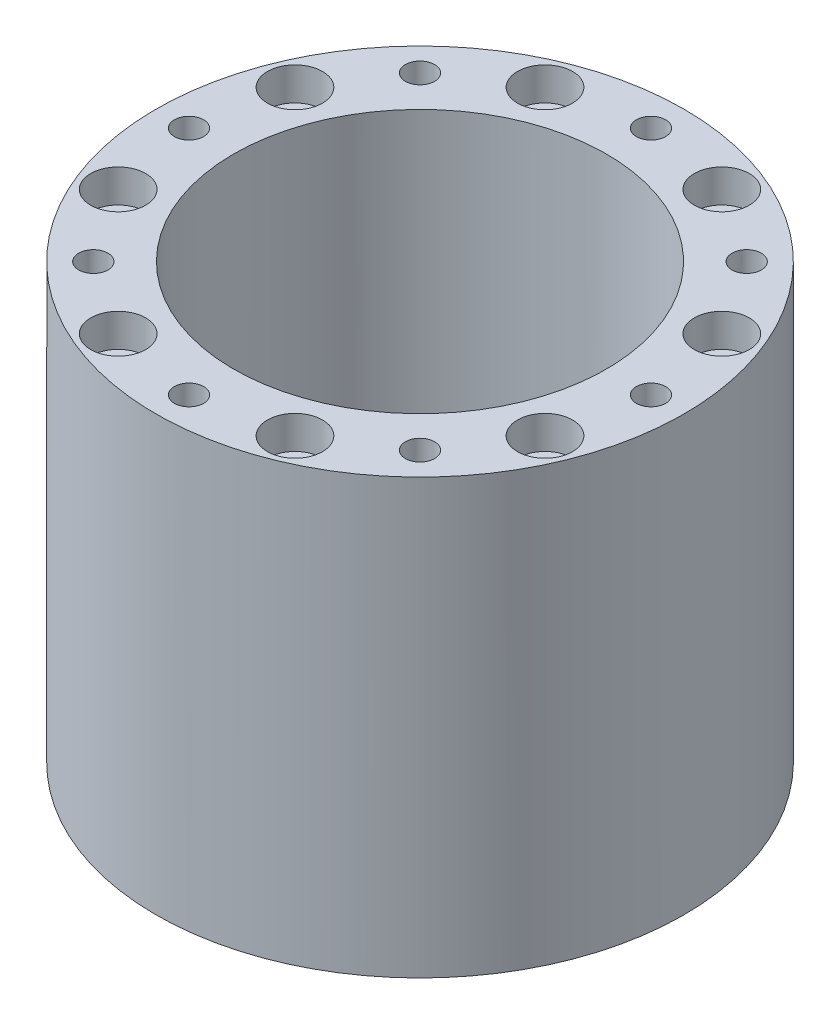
ISO-10303-21;
HEADER;
FILE_DESCRIPTION(('STEP AP214'),'2;1');
FILE_NAME('part.step','',(''),(''),'','','');
FILE_SCHEMA(('AUTOMOTIVE_DESIGN { 1 0 10303 214 1 1 1 1 }'));
ENDSEC;
DATA;
#1=APPLICATION_CONTEXT('core data for automotive mechanical design processes');
#2=APPLICATION_PROTOCOL_DEFINITION('international standard','automotive_design',2000,#1);
#3=PRODUCT_CONTEXT('',#1,'mechanical');
#4=PRODUCT('Part','Part','',(#3));
#5=PRODUCT_RELATED_PRODUCT_CATEGORY('part','',(#4));
#6=PRODUCT_DEFINITION_FORMATION('','',#4);
#7=PRODUCT_DEFINITION_CONTEXT('part definition',#1,'design');
#8=PRODUCT_DEFINITION('design','',#6,#7);
#9=PRODUCT_DEFINITION_SHAPE('','',#8);
#10=(LENGTH_UNIT() NAMED_UNIT(*) SI_UNIT(.MILLI.,.METRE.));
#11=(NAMED_UNIT(*) PLANE_ANGLE_UNIT() SI_UNIT($,.RADIAN.));
#12=(NAMED_UNIT(*) SI_UNIT($,.STERADIAN.) SOLID_ANGLE_UNIT());
#13=UNCERTAINTY_MEASURE_WITH_UNIT(LENGTH_MEASURE(1.E-05),#10,'distance_accuracy_value','');
#14=(GEOMETRIC_REPRESENTATION_CONTEXT(3) GLOBAL_UNCERTAINTY_ASSIGNED_CONTEXT((#13)) GLOBAL_UNIT_ASSIGNED_CONTEXT((#10,
#11,#12)) REPRESENTATION_CONTEXT('',''));
#15=CARTESIAN_POINT('',(0.,0.,0.));
#16=DIRECTION('',(0.,0.,1.));
#17=DIRECTION('',(1.,0.,0.));
#18=AXIS2_PLACEMENT_3D('',#15,#16,#17);
#19=CARTESIAN_POINT('',(63.7922857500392,0.,41.677143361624));
#20=DIRECTION('',(0.,-1.,0.));
#21=DIRECTION('',(0.546944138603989,0.,-0.837169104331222));
#22=AXIS2_PLACEMENT_3D('',#19,#20,#21);
#23=PLANE('',#22);
#24=CARTESIAN_POINT('',(61.5996678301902,0.,-25.515417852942));
#25=DIRECTION('',(0.,1.,0.));
#26=DIRECTION('',(0.,0.,1.));
#27=AXIS2_PLACEMENT_3D('',#24,#25,#26);
#28=CIRCLE('',#27,7.93750000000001);
#29=CARTESIAN_POINT('',(61.5996678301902,0.,-17.577917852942));
#30=VERTEX_POINT('',#29);
#31=EDGE_CURVE('E661',#30,#30,#28,.T.);
#32=ORIENTED_EDGE('',*,*,#31,.F.);
#33=EDGE_LOOP('',(#32));
#34=FACE_BOUND('',#33,.T.);
#35=CARTESIAN_POINT('',(-25.5154178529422,0.,-61.5996678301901));
#36=DIRECTION('',(0.,1.,0.));
#37=DIRECTION('',(0.,0.,1.));
#38=AXIS2_PLACEMENT_3D('',#35,#36,#37);
#39=CIRCLE('',#38,7.9375);
#40=CARTESIAN_POINT('',(-25.5154178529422,0.,-53.6621678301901));
#41=VERTEX_POINT('',#40);
#42=EDGE_CURVE('E192',#41,#41,#39,.T.);
#43=ORIENTED_EDGE('',*,*,#42,.F.);
#44=EDGE_LOOP('',(#43));
#45=FACE_BOUND('',#44,.T.);
#46=CARTESIAN_POINT('',(-61.5996678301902,0.,-25.515417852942));
#47=DIRECTION('',(0.,1.,0.));
#48=DIRECTION('',(0.,0.,1.));
#49=AXIS2_PLACEMENT_3D('',#46,#47,#48);
#50=CIRCLE('',#49,7.9375);
#51=CARTESIAN_POINT('',(-61.5996678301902,0.,-17.577917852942));
#52=VERTEX_POINT('',#51);
#53=EDGE_CURVE('E204',#52,#52,#50,.T.);
#54=ORIENTED_EDGE('',*,*,#53,.F.);
#55=EDGE_LOOP('',(#54));
#56=FACE_BOUND('',#55,.T.);
#57=CARTESIAN_POINT('',(-61.59966783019,0.,25.5154178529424));
#58=DIRECTION('',(0.,1.,0.));
#59=DIRECTION('',(0.,0.,1.));
#60=AXIS2_PLACEMENT_3D('',#57,#58,#59);
#61=CIRCLE('',#60,7.9375);
#62=CARTESIAN_POINT('',(-61.59966783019,0.,33.4529178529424));
#63=VERTEX_POINT('',#62);
#64=EDGE_CURVE('E216',#63,#63,#61,.T.);
#65=ORIENTED_EDGE('',*,*,#64,.F.);
#66=EDGE_LOOP('',(#65));
#67=FACE_BOUND('',#66,.T.);
#68=CARTESIAN_POINT('',(-25.5154178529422,0.,61.5996678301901));
#69=DIRECTION('',(0.,1.,0.));
#70=DIRECTION('',(0.,0.,1.));
#71=AXIS2_PLACEMENT_3D('',#68,#69,#70);
#72=CIRCLE('',#71,7.9375);
#73=CARTESIAN_POINT('',(-25.5154178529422,0.,69.5371678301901));
#74=VERTEX_POINT('',#73);
#75=EDGE_CURVE('E228',#74,#74,#72,.T.);
#76=ORIENTED_EDGE('',*,*,#75,.F.);
#77=EDGE_LOOP('',(#76));
#78=FACE_BOUND('',#77,.T.);
#79=CARTESIAN_POINT('',(25.5154178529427,0.,61.5996678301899));
#80=DIRECTION('',(0.,1.,0.));
#81=DIRECTION('',(0.,0.,1.));
#82=AXIS2_PLACEMENT_3D('',#79,#80,#81);
#83=CIRCLE('',#82,7.9375);
#84=CARTESIAN_POINT('',(25.5154178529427,0.,69.5371678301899));
#85=VERTEX_POINT('',#84);
#86=EDGE_CURVE('E240',#85,#85,#83,.T.);
#87=ORIENTED_EDGE('',*,*,#86,.F.);
#88=EDGE_LOOP('',(#87));
#89=FACE_BOUND('',#88,.T.);
#90=CARTESIAN_POINT('',(47.1463446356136,0.,-47.1463446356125));
#91=DIRECTION('',(0.,1.,0.));
#92=DIRECTION('',(0.,0.,1.));
#93=AXIS2_PLACEMENT_3D('',#90,#91,#92);
#94=CIRCLE('',#93,4.21639999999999);
#95=CARTESIAN_POINT('',(47.1463446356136,0.,-42.9299446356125));
#96=VERTEX_POINT('',#95);
#97=EDGE_CURVE('E94',#96,#96,#94,.T.);
#98=ORIENTED_EDGE('',*,*,#97,.F.);
#99=EDGE_LOOP('',(#98));
#100=FACE_BOUND('',#99,.T.);
#101=CARTESIAN_POINT('',(6.98383554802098E-13,0.,-66.675));
#102=DIRECTION('',(0.,1.,0.));
#103=DIRECTION('',(0.,0.,1.));
#104=AXIS2_PLACEMENT_3D('',#101,#102,#103);
#105=CIRCLE('',#104,4.21639999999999);
#106=CARTESIAN_POINT('',(6.98383554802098E-13,0.,-62.4586));
#107=VERTEX_POINT('',#106);
#108=EDGE_CURVE('E93',#107,#107,#105,.T.);
#109=ORIENTED_EDGE('',*,*,#108,.F.);
#110=EDGE_LOOP('',(#109));
#111=FACE_BOUND('',#110,.T.);
#112=CARTESIAN_POINT('',(-47.1463446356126,0.,-47.1463446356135));
#113=DIRECTION('',(0.,1.,0.));
#114=DIRECTION('',(0.,0.,1.));
#115=AXIS2_PLACEMENT_3D('',#112,#113,#114);
#116=CIRCLE('',#115,4.21639999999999);
#117=CARTESIAN_POINT('',(-47.1463446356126,0.,-42.9299446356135));
#118=VERTEX_POINT('',#117);
#119=EDGE_CURVE('E106',#118,#118,#116,.T.);
#120=ORIENTED_EDGE('',*,*,#119,.F.);
#121=EDGE_LOOP('',(#120));
#122=FACE_BOUND('',#121,.T.);
#123=CARTESIAN_POINT('',(-66.675,0.,0.));
#124=DIRECTION('',(0.,1.,0.));
#125=DIRECTION('',(0.,0.,1.));
#126=AXIS2_PLACEMENT_3D('',#123,#124,#125);
#127=CIRCLE('',#126,4.21639999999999);
#128=CARTESIAN_POINT('',(-66.675,0.,4.21639999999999));
#129=VERTEX_POINT('',#128);
#130=EDGE_CURVE('E112',#129,#129,#127,.T.);
#131=ORIENTED_EDGE('',*,*,#130,.F.);
#132=EDGE_LOOP('',(#131));
#133=FACE_BOUND('',#132,.T.);
#134=CARTESIAN_POINT('',(-47.1463446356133,0.,47.1463446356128));
#135=DIRECTION('',(0.,1.,0.));
#136=DIRECTION('',(0.,0.,1.));
#137=AXIS2_PLACEMENT_3D('',#134,#135,#136);
#138=CIRCLE('',#137,4.21639999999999);
#139=CARTESIAN_POINT('',(-47.1463446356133,0.,51.3627446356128));
#140=VERTEX_POINT('',#139);
#141=EDGE_CURVE('E118',#140,#140,#138,.T.);
#142=ORIENTED_EDGE('',*,*,#141,.F.);
#143=EDGE_LOOP('',(#142));
#144=FACE_BOUND('',#143,.T.);
#145=CARTESIAN_POINT('',(-2.32794518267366E-13,0.,66.675));
#146=DIRECTION('',(0.,1.,0.));
#147=DIRECTION('',(0.,0.,1.));
#148=AXIS2_PLACEMENT_3D('',#145,#146,#147);
#149=CIRCLE('',#148,4.21639999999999);
#150=CARTESIAN_POINT('',(-2.32794518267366E-13,0.,70.8914));
#151=VERTEX_POINT('',#150);
#152=EDGE_CURVE('E124',#151,#151,#149,.T.);
#153=ORIENTED_EDGE('',*,*,#152,.F.);
#154=EDGE_LOOP('',(#153));
#155=FACE_BOUND('',#154,.T.);
#156=CARTESIAN_POINT('',(47.146344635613,0.,47.1463446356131));
#157=DIRECTION('',(0.,1.,0.));
#158=DIRECTION('',(0.,0.,1.));
#159=AXIS2_PLACEMENT_3D('',#156,#157,#158);
#160=CIRCLE('',#159,4.21639999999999);
#161=CARTESIAN_POINT('',(47.146344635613,0.,51.3627446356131));
#162=VERTEX_POINT('',#161);
#163=EDGE_CURVE('E130',#162,#162,#160,.T.);
#164=ORIENTED_EDGE('',*,*,#163,.F.);
#165=EDGE_LOOP('',(#164));
#166=FACE_BOUND('',#165,.T.);
#167=CARTESIAN_POINT('',(66.675,0.,0.));
#168=DIRECTION('',(0.,1.,0.));
#169=DIRECTION('',(0.,0.,1.));
#170=AXIS2_PLACEMENT_3D('',#167,#168,#169);
#171=CIRCLE('',#170,4.21639999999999);
#172=CARTESIAN_POINT('',(66.675,0.,4.21639999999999));
#173=VERTEX_POINT('',#172);
#174=EDGE_CURVE('E136',#173,#173,#171,.T.);
#175=ORIENTED_EDGE('',*,*,#174,.F.);
#176=EDGE_LOOP('',(#175));
#177=FACE_BOUND('',#176,.T.);
#178=CARTESIAN_POINT('',(0.,0.,0.));
#179=DIRECTION('',(0.,-1.,0.));
#180=DIRECTION('',(0.546944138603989,0.,-0.837169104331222));
#181=AXIS2_PLACEMENT_3D('',#178,#179,#180);
#182=CIRCLE('',#181,76.2);
#183=CARTESIAN_POINT('',(41.6771433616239,0.,-63.7922857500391));
#184=VERTEX_POINT('',#183);
#185=EDGE_CURVE('E142',#184,#184,#182,.T.);
#186=ORIENTED_EDGE('',*,*,#185,.F.);
#187=EDGE_LOOP('',(#186));
#188=FACE_BOUND('',#187,.T.);
#189=CARTESIAN_POINT('',(0.,0.,0.));
#190=DIRECTION('',(0.,-1.,0.));
#191=DIRECTION('',(0.546944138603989,0.,-0.837169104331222));
#192=AXIS2_PLACEMENT_3D('',#189,#190,#191);
#193=CIRCLE('',#192,53.7924602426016);
#194=CARTESIAN_POINT('',(29.421470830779,0.,-45.0333857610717));
#195=VERTEX_POINT('',#194);
#196=EDGE_CURVE('E145',#195,#195,#193,.T.);
#197=ORIENTED_EDGE('',*,*,#196,.T.);
#198=EDGE_LOOP('',(#197));
#199=FACE_BOUND('',#198,.T.);
#200=CARTESIAN_POINT('',(61.5996678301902,0.,25.515417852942));
#201=DIRECTION('',(0.,1.,0.));
#202=DIRECTION('',(0.,0.,1.));
#203=AXIS2_PLACEMENT_3D('',#200,#201,#202);
#204=CIRCLE('',#203,7.9375);
#205=CARTESIAN_POINT('',(61.5996678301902,0.,33.452917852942));
#206=VERTEX_POINT('',#205);
#207=EDGE_CURVE('E171',#206,#206,#204,.T.);
#208=ORIENTED_EDGE('',*,*,#207,.F.);
#209=EDGE_LOOP('',(#208));
#210=FACE_BOUND('',#209,.T.);
#211=CARTESIAN_POINT('',(25.5154178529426,0.,-61.59966783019));
#212=DIRECTION('',(0.,1.,0.));
#213=DIRECTION('',(0.,0.,1.));
#214=AXIS2_PLACEMENT_3D('',#211,#212,#213);
#215=CIRCLE('',#214,7.9375);
#216=CARTESIAN_POINT('',(25.5154178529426,0.,-53.66216783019));
#217=VERTEX_POINT('',#216);
#218=EDGE_CURVE('E174',#217,#217,#215,.T.);
#219=ORIENTED_EDGE('',*,*,#218,.F.);
#220=EDGE_LOOP('',(#219));
#221=FACE_BOUND('',#220,.T.);
#222=ADVANCED_FACE('F50',(#34,#45,#56,#67,#78,#89,#100,#111,#122,#133,#144,#155,#166,#177,#188,
#199,#210,#221),#23,.F.);
#223=CARTESIAN_POINT('',(-105.474898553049,-125.205020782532,22.1235140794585));
#224=DIRECTION('',(0.,1.,0.));
#225=DIRECTION('',(-0.546944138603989,0.,0.837169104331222));
#226=AXIS2_PLACEMENT_3D('',#223,#224,#225);
#227=PLANE('',#226);
#228=CARTESIAN_POINT('',(61.5996678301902,-125.205020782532,-25.515417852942));
#229=DIRECTION('',(0.,1.,0.));
#230=DIRECTION('',(0.,0.,1.));
#231=AXIS2_PLACEMENT_3D('',#228,#229,#230);
#232=CIRCLE('',#231,4.90219999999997);
#233=CARTESIAN_POINT('',(61.5996678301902,-125.205020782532,-20.613217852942));
#234=VERTEX_POINT('',#233);
#235=EDGE_CURVE('E177',#234,#234,#232,.T.);
#236=ORIENTED_EDGE('',*,*,#235,.T.);
#237=EDGE_LOOP('',(#236));
#238=FACE_BOUND('',#237,.T.);
#239=CARTESIAN_POINT('',(25.5154178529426,-125.205020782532,-61.59966783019));
#240=DIRECTION('',(0.,1.,0.));
#241=DIRECTION('',(0.,0.,1.));
#242=AXIS2_PLACEMENT_3D('',#239,#240,#241);
#243=CIRCLE('',#242,4.90219999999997);
#244=CARTESIAN_POINT('',(25.5154178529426,-125.205020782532,-56.69746783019));
#245=VERTEX_POINT('',#244);
#246=EDGE_CURVE('E189',#245,#245,#243,.T.);
#247=ORIENTED_EDGE('',*,*,#246,.T.);
#248=EDGE_LOOP('',(#247));
#249=FACE_BOUND('',#248,.T.);
#250=CARTESIAN_POINT('',(-25.5154178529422,-125.205020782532,-61.5996678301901));
#251=DIRECTION('',(0.,1.,0.));
#252=DIRECTION('',(0.,0.,1.));
#253=AXIS2_PLACEMENT_3D('',#250,#251,#252);
#254=CIRCLE('',#253,4.90219999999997);
#255=CARTESIAN_POINT('',(-25.5154178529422,-125.205020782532,-56.6974678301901));
#256=VERTEX_POINT('',#255);
#257=EDGE_CURVE('E201',#256,#256,#254,.T.);
#258=ORIENTED_EDGE('',*,*,#257,.T.);
#259=EDGE_LOOP('',(#258));
#260=FACE_BOUND('',#259,.T.);
#261=CARTESIAN_POINT('',(-61.5996678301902,-125.205020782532,-25.515417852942));
#262=DIRECTION('',(0.,1.,0.));
#263=DIRECTION('',(0.,0.,1.));
#264=AXIS2_PLACEMENT_3D('',#261,#262,#263);
#265=CIRCLE('',#264,4.90219999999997);
#266=CARTESIAN_POINT('',(-61.5996678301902,-125.205020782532,-20.613217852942));
#267=VERTEX_POINT('',#266);
#268=EDGE_CURVE('E213',#267,#267,#265,.T.);
#269=ORIENTED_EDGE('',*,*,#268,.T.);
#270=EDGE_LOOP('',(#269));
#271=FACE_BOUND('',#270,.T.);
#272=CARTESIAN_POINT('',(-61.59966783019,-125.205020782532,25.5154178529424));
#273=DIRECTION('',(0.,1.,0.));
#274=DIRECTION('',(0.,0.,1.));
#275=AXIS2_PLACEMENT_3D('',#272,#273,#274);
#276=CIRCLE('',#275,4.90219999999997);
#277=CARTESIAN_POINT('',(-61.59966783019,-125.205020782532,30.4176178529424));
#278=VERTEX_POINT('',#277);
#279=EDGE_CURVE('E225',#278,#278,#276,.T.);
#280=ORIENTED_EDGE('',*,*,#279,.T.);
#281=EDGE_LOOP('',(#280));
#282=FACE_BOUND('',#281,.T.);
#283=CARTESIAN_POINT('',(-25.5154178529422,-125.205020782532,61.5996678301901));
#284=DIRECTION('',(0.,1.,0.));
#285=DIRECTION('',(0.,0.,1.));
#286=AXIS2_PLACEMENT_3D('',#283,#284,#285);
#287=CIRCLE('',#286,4.90219999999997);
#288=CARTESIAN_POINT('',(-25.5154178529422,-125.205020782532,66.5018678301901));
#289=VERTEX_POINT('',#288);
#290=EDGE_CURVE('E237',#289,#289,#287,.T.);
#291=ORIENTED_EDGE('',*,*,#290,.T.);
#292=EDGE_LOOP('',(#291));
#293=FACE_BOUND('',#292,.T.);
#294=CARTESIAN_POINT('',(25.5154178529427,-125.205020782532,61.5996678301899));
#295=DIRECTION('',(0.,1.,0.));
#296=DIRECTION('',(0.,0.,1.));
#297=AXIS2_PLACEMENT_3D('',#294,#295,#296);
#298=CIRCLE('',#297,4.90219999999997);
#299=CARTESIAN_POINT('',(25.5154178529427,-125.205020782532,66.5018678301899));
#300=VERTEX_POINT('',#299);
#301=EDGE_CURVE('E249',#300,#300,#298,.T.);
#302=ORIENTED_EDGE('',*,*,#301,.T.);
#303=EDGE_LOOP('',(#302));
#304=FACE_BOUND('',#303,.T.);
#305=CARTESIAN_POINT('',(61.5996678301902,-125.205020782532,25.515417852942));
#306=DIRECTION('',(0.,1.,0.));
#307=DIRECTION('',(0.,0.,1.));
#308=AXIS2_PLACEMENT_3D('',#305,#306,#307);
#309=CIRCLE('',#308,4.90219999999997);
#310=CARTESIAN_POINT('',(61.5996678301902,-125.205020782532,30.4176178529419));
#311=VERTEX_POINT('',#310);
#312=EDGE_CURVE('E100',#311,#311,#309,.T.);
#313=ORIENTED_EDGE('',*,*,#312,.T.);
#314=EDGE_LOOP('',(#313));
#315=FACE_BOUND('',#314,.T.);
#316=CARTESIAN_POINT('',(0.,-125.205020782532,0.));
#317=DIRECTION('',(0.,1.,0.));
#318=DIRECTION('',(-0.546944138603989,0.,0.837169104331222));
#319=AXIS2_PLACEMENT_3D('',#316,#317,#318);
#320=CIRCLE('',#319,76.2);
#321=CARTESIAN_POINT('',(-41.6771433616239,-125.205020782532,63.7922857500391));
#322=VERTEX_POINT('',#321);
#323=EDGE_CURVE('E58',#322,#322,#320,.T.);
#324=ORIENTED_EDGE('',*,*,#323,.F.);
#325=EDGE_LOOP('',(#324));
#326=FACE_BOUND('',#325,.T.);
#327=CARTESIAN_POINT('',(0.,-125.205020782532,0.));
#328=DIRECTION('',(0.,1.,0.));
#329=DIRECTION('',(-0.546944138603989,0.,0.837169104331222));
#330=AXIS2_PLACEMENT_3D('',#327,#328,#329);
#331=CIRCLE('',#330,53.7924602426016);
#332=CARTESIAN_POINT('',(-29.421470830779,-125.205020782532,45.0333857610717));
#333=VERTEX_POINT('',#332);
#334=EDGE_CURVE('E13',#333,#333,#331,.F.);
#335=ORIENTED_EDGE('',*,*,#334,.F.);
#336=EDGE_LOOP('',(#335));
#337=FACE_BOUND('',#336,.T.);
#338=ADVANCED_FACE('F52',(#238,#249,#260,#271,#282,#293,#304,#315,#326,#337),#227,.F.);
#339=CARTESIAN_POINT('',(0.,-193.077673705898,0.));
#340=DIRECTION('',(0.,-1.,0.));
#341=DIRECTION('',(0.546944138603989,0.,-0.837169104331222));
#342=AXIS2_PLACEMENT_3D('',#339,#340,#341);
#343=CYLINDRICAL_SURFACE('',#342,76.2);
#344=ORIENTED_EDGE('',*,*,#323,.T.);
#345=EDGE_LOOP('',(#344));
#346=FACE_BOUND('',#345,.T.);
#347=ORIENTED_EDGE('',*,*,#185,.T.);
#348=EDGE_LOOP('',(#347));
#349=FACE_BOUND('',#348,.T.);
#350=ADVANCED_FACE('F150',(#346,#349),#343,.T.);
#351=CARTESIAN_POINT('',(0.,-193.077673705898,0.));
#352=DIRECTION('',(0.,-1.,0.));
#353=DIRECTION('',(0.546944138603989,0.,-0.837169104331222));
#354=AXIS2_PLACEMENT_3D('',#351,#352,#353);
#355=CYLINDRICAL_SURFACE('',#354,53.7924602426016);
#356=ORIENTED_EDGE('',*,*,#334,.T.);
#357=EDGE_LOOP('',(#356));
#358=FACE_BOUND('',#357,.T.);
#359=ORIENTED_EDGE('',*,*,#196,.F.);
#360=EDGE_LOOP('',(#359));
#361=FACE_BOUND('',#360,.T.);
#362=ADVANCED_FACE('F156',(#358,#361),#355,.F.);
#363=CARTESIAN_POINT('',(66.675,-22.22754,0.));
#364=DIRECTION('',(0.,1.,0.));
#365=DIRECTION('',(0.,0.,1.));
#366=AXIS2_PLACEMENT_3D('',#363,#364,#365);
#367=CONICAL_SURFACE('',#366,4.21639999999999,1.02974425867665);
#368=CARTESIAN_POINT('',(66.675,-24.7610087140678,0.));
#369=VERTEX_POINT('',#368);
#370=VERTEX_LOOP('',#369);
#371=FACE_BOUND('',#370,.T.);
#372=CARTESIAN_POINT('',(66.675,-22.22754,0.));
#373=DIRECTION('',(0.,1.,0.));
#374=DIRECTION('',(0.,0.,1.));
#375=AXIS2_PLACEMENT_3D('',#372,#373,#374);
#376=CIRCLE('',#375,4.21639999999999);
#377=CARTESIAN_POINT('',(66.675,-22.22754,4.21639999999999));
#378=VERTEX_POINT('',#377);
#379=EDGE_CURVE('E139',#378,#378,#376,.T.);
#380=ORIENTED_EDGE('',*,*,#379,.T.);
#381=EDGE_LOOP('',(#380));
#382=FACE_BOUND('',#381,.T.);
#383=ADVANCED_FACE('F161',(#371,#382),#367,.F.);
#384=CARTESIAN_POINT('',(66.675,0.,0.));
#385=DIRECTION('',(0.,1.,0.));
#386=DIRECTION('',(0.,0.,1.));
#387=AXIS2_PLACEMENT_3D('',#384,#385,#386);
#388=CYLINDRICAL_SURFACE('',#387,4.21639999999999);
#389=ORIENTED_EDGE('',*,*,#379,.F.);
#390=EDGE_LOOP('',(#389));
#391=FACE_BOUND('',#390,.T.);
#392=ORIENTED_EDGE('',*,*,#174,.T.);
#393=EDGE_LOOP('',(#392));
#394=FACE_BOUND('',#393,.T.);
#395=ADVANCED_FACE('F335',(#391,#394),#388,.F.);
#396=CARTESIAN_POINT('',(47.146344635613,-22.22754,47.1463446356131));
#397=DIRECTION('',(0.,1.,0.));
#398=DIRECTION('',(0.,0.,1.));
#399=AXIS2_PLACEMENT_3D('',#396,#397,#398);
#400=CONICAL_SURFACE('',#399,4.21639999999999,1.02974425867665);
#401=CARTESIAN_POINT('',(47.146344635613,-24.7610087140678,47.1463446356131));
#402=VERTEX_POINT('',#401);
#403=VERTEX_LOOP('',#402);
#404=FACE_BOUND('',#403,.T.);
#405=CARTESIAN_POINT('',(47.146344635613,-22.22754,47.1463446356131));
#406=DIRECTION('',(0.,1.,0.));
#407=DIRECTION('',(0.,0.,1.));
#408=AXIS2_PLACEMENT_3D('',#405,#406,#407);
#409=CIRCLE('',#408,4.21639999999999);
#410=CARTESIAN_POINT('',(47.146344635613,-22.22754,51.3627446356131));
#411=VERTEX_POINT('',#410);
#412=EDGE_CURVE('E133',#411,#411,#409,.T.);
#413=ORIENTED_EDGE('',*,*,#412,.T.);
#414=EDGE_LOOP('',(#413));
#415=FACE_BOUND('',#414,.T.);
#416=ADVANCED_FACE('F331',(#404,#415),#400,.F.);
#417=CARTESIAN_POINT('',(47.146344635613,0.,47.1463446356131));
#418=DIRECTION('',(0.,1.,0.));
#419=DIRECTION('',(0.,0.,1.));
#420=AXIS2_PLACEMENT_3D('',#417,#418,#419);
#421=CYLINDRICAL_SURFACE('',#420,4.21639999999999);
#422=ORIENTED_EDGE('',*,*,#412,.F.);
#423=EDGE_LOOP('',(#422));
#424=FACE_BOUND('',#423,.T.);
#425=ORIENTED_EDGE('',*,*,#163,.T.);
#426=EDGE_LOOP('',(#425));
#427=FACE_BOUND('',#426,.T.);
#428=ADVANCED_FACE('F327',(#424,#427),#421,.F.);
#429=CARTESIAN_POINT('',(-2.32794518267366E-13,-22.22754,66.675));
#430=DIRECTION('',(0.,1.,0.));
#431=DIRECTION('',(0.,0.,1.));
#432=AXIS2_PLACEMENT_3D('',#429,#430,#431);
#433=CONICAL_SURFACE('',#432,4.21639999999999,1.02974425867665);
#434=CARTESIAN_POINT('',(-2.38859216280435E-13,-24.7610087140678,66.675));
#435=VERTEX_POINT('',#434);
#436=VERTEX_LOOP('',#435);
#437=FACE_BOUND('',#436,.T.);
#438=CARTESIAN_POINT('',(-2.32794518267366E-13,-22.22754,66.675));
#439=DIRECTION('',(0.,1.,0.));
#440=DIRECTION('',(0.,0.,1.));
#441=AXIS2_PLACEMENT_3D('',#438,#439,#440);
#442=CIRCLE('',#441,4.21639999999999);
#443=CARTESIAN_POINT('',(-2.32794518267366E-13,-22.22754,70.8914));
#444=VERTEX_POINT('',#443);
#445=EDGE_CURVE('E127',#444,#444,#442,.T.);
#446=ORIENTED_EDGE('',*,*,#445,.T.);
#447=EDGE_LOOP('',(#446));
#448=FACE_BOUND('',#447,.T.);
#449=ADVANCED_FACE('F323',(#437,#448),#433,.F.);
#450=CARTESIAN_POINT('',(-2.32794518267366E-13,0.,66.675));
#451=DIRECTION('',(0.,1.,0.));
#452=DIRECTION('',(0.,0.,1.));
#453=AXIS2_PLACEMENT_3D('',#450,#451,#452);
#454=CYLINDRICAL_SURFACE('',#453,4.21639999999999);
#455=ORIENTED_EDGE('',*,*,#445,.F.);
#456=EDGE_LOOP('',(#455));
#457=FACE_BOUND('',#456,.T.);
#458=ORIENTED_EDGE('',*,*,#152,.T.);
#459=EDGE_LOOP('',(#458));
#460=FACE_BOUND('',#459,.T.);
#461=ADVANCED_FACE('F319',(#457,#460),#454,.F.);
#462=CARTESIAN_POINT('',(-47.1463446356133,-22.22754,47.1463446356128));
#463=DIRECTION('',(0.,1.,0.));
#464=DIRECTION('',(0.,0.,1.));
#465=AXIS2_PLACEMENT_3D('',#462,#463,#464);
#466=CONICAL_SURFACE('',#465,4.21639999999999,1.02974425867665);
#467=CARTESIAN_POINT('',(-47.1463446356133,-24.7610087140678,47.1463446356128));
#468=VERTEX_POINT('',#467);
#469=VERTEX_LOOP('',#468);
#470=FACE_BOUND('',#469,.T.);
#471=CARTESIAN_POINT('',(-47.1463446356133,-22.22754,47.1463446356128));
#472=DIRECTION('',(0.,1.,0.));
#473=DIRECTION('',(0.,0.,1.));
#474=AXIS2_PLACEMENT_3D('',#471,#472,#473);
#475=CIRCLE('',#474,4.21639999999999);
#476=CARTESIAN_POINT('',(-47.1463446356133,-22.22754,51.3627446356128));
#477=VERTEX_POINT('',#476);
#478=EDGE_CURVE('E121',#477,#477,#475,.T.);
#479=ORIENTED_EDGE('',*,*,#478,.T.);
#480=EDGE_LOOP('',(#479));
#481=FACE_BOUND('',#480,.T.);
#482=ADVANCED_FACE('F315',(#470,#481),#466,.F.);
#483=CARTESIAN_POINT('',(-47.1463446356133,0.,47.1463446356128));
#484=DIRECTION('',(0.,1.,0.));
#485=DIRECTION('',(0.,0.,1.));
#486=AXIS2_PLACEMENT_3D('',#483,#484,#485);
#487=CYLINDRICAL_SURFACE('',#486,4.21639999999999);
#488=ORIENTED_EDGE('',*,*,#478,.F.);
#489=EDGE_LOOP('',(#488));
#490=FACE_BOUND('',#489,.T.);
#491=ORIENTED_EDGE('',*,*,#141,.T.);
#492=EDGE_LOOP('',(#491));
#493=FACE_BOUND('',#492,.T.);
#494=ADVANCED_FACE('F311',(#490,#493),#487,.F.);
#495=CARTESIAN_POINT('',(-66.675,-22.22754,0.));
#496=DIRECTION('',(0.,1.,0.));
#497=DIRECTION('',(0.,0.,1.));
#498=AXIS2_PLACEMENT_3D('',#495,#496,#497);
#499=CONICAL_SURFACE('',#498,4.21639999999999,1.02974425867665);
#500=CARTESIAN_POINT('',(-66.675,-24.7610087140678,0.));
#501=VERTEX_POINT('',#500);
#502=VERTEX_LOOP('',#501);
#503=FACE_BOUND('',#502,.T.);
#504=CARTESIAN_POINT('',(-66.675,-22.22754,0.));
#505=DIRECTION('',(0.,1.,0.));
#506=DIRECTION('',(0.,0.,1.));
#507=AXIS2_PLACEMENT_3D('',#504,#505,#506);
#508=CIRCLE('',#507,4.21639999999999);
#509=CARTESIAN_POINT('',(-66.675,-22.22754,4.21639999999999));
#510=VERTEX_POINT('',#509);
#511=EDGE_CURVE('E115',#510,#510,#508,.T.);
#512=ORIENTED_EDGE('',*,*,#511,.T.);
#513=EDGE_LOOP('',(#512));
#514=FACE_BOUND('',#513,.T.);
#515=ADVANCED_FACE('F307',(#503,#514),#499,.F.);
#516=CARTESIAN_POINT('',(-66.675,0.,0.));
#517=DIRECTION('',(0.,1.,0.));
#518=DIRECTION('',(0.,0.,1.));
#519=AXIS2_PLACEMENT_3D('',#516,#517,#518);
#520=CYLINDRICAL_SURFACE('',#519,4.21639999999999);
#521=ORIENTED_EDGE('',*,*,#511,.F.);
#522=EDGE_LOOP('',(#521));
#523=FACE_BOUND('',#522,.T.);
#524=ORIENTED_EDGE('',*,*,#130,.T.);
#525=EDGE_LOOP('',(#524));
#526=FACE_BOUND('',#525,.T.);
#527=ADVANCED_FACE('F303',(#523,#526),#520,.F.);
#528=CARTESIAN_POINT('',(-47.1463446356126,-22.22754,-47.1463446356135));
#529=DIRECTION('',(0.,1.,0.));
#530=DIRECTION('',(0.,0.,1.));
#531=AXIS2_PLACEMENT_3D('',#528,#529,#530);
#532=CONICAL_SURFACE('',#531,4.21639999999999,1.02974425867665);
#533=CARTESIAN_POINT('',(-47.1463446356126,-24.7610087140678,-47.1463446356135));
#534=VERTEX_POINT('',#533);
#535=VERTEX_LOOP('',#534);
#536=FACE_BOUND('',#535,.T.);
#537=CARTESIAN_POINT('',(-47.1463446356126,-22.22754,-47.1463446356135));
#538=DIRECTION('',(0.,1.,0.));
#539=DIRECTION('',(0.,0.,1.));
#540=AXIS2_PLACEMENT_3D('',#537,#538,#539);
#541=CIRCLE('',#540,4.21639999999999);
#542=CARTESIAN_POINT('',(-47.1463446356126,-22.22754,-42.9299446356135));
#543=VERTEX_POINT('',#542);
#544=EDGE_CURVE('E109',#543,#543,#541,.T.);
#545=ORIENTED_EDGE('',*,*,#544,.T.);
#546=EDGE_LOOP('',(#545));
#547=FACE_BOUND('',#546,.T.);
#548=ADVANCED_FACE('F299',(#536,#547),#532,.F.);
#549=CARTESIAN_POINT('',(-47.1463446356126,0.,-47.1463446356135));
#550=DIRECTION('',(0.,1.,0.));
#551=DIRECTION('',(0.,0.,1.));
#552=AXIS2_PLACEMENT_3D('',#549,#550,#551);
#553=CYLINDRICAL_SURFACE('',#552,4.21639999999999);
#554=ORIENTED_EDGE('',*,*,#544,.F.);
#555=EDGE_LOOP('',(#554));
#556=FACE_BOUND('',#555,.T.);
#557=ORIENTED_EDGE('',*,*,#119,.T.);
#558=EDGE_LOOP('',(#557));
#559=FACE_BOUND('',#558,.T.);
#560=ADVANCED_FACE('F295',(#556,#559),#553,.F.);
#561=CARTESIAN_POINT('',(6.98383554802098E-13,-22.22754,-66.675));
#562=DIRECTION('',(0.,1.,0.));
#563=DIRECTION('',(0.,0.,1.));
#564=AXIS2_PLACEMENT_3D('',#561,#562,#563);
#565=CONICAL_SURFACE('',#564,4.21639999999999,1.02974425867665);
#566=CARTESIAN_POINT('',(6.92318856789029E-13,-24.7610087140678,-66.675));
#567=VERTEX_POINT('',#566);
#568=VERTEX_LOOP('',#567);
#569=FACE_BOUND('',#568,.T.);
#570=CARTESIAN_POINT('',(6.98383554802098E-13,-22.22754,-66.675));
#571=DIRECTION('',(0.,1.,0.));
#572=DIRECTION('',(0.,0.,1.));
#573=AXIS2_PLACEMENT_3D('',#570,#571,#572);
#574=CIRCLE('',#573,4.21639999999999);
#575=CARTESIAN_POINT('',(6.98383554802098E-13,-22.22754,-62.4586));
#576=VERTEX_POINT('',#575);
#577=EDGE_CURVE('E97',#576,#576,#574,.T.);
#578=ORIENTED_EDGE('',*,*,#577,.T.);
#579=EDGE_LOOP('',(#578));
#580=FACE_BOUND('',#579,.T.);
#581=ADVANCED_FACE('F291',(#569,#580),#565,.F.);
#582=CARTESIAN_POINT('',(6.98383554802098E-13,0.,-66.675));
#583=DIRECTION('',(0.,1.,0.));
#584=DIRECTION('',(0.,0.,1.));
#585=AXIS2_PLACEMENT_3D('',#582,#583,#584);
#586=CYLINDRICAL_SURFACE('',#585,4.21639999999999);
#587=ORIENTED_EDGE('',*,*,#577,.F.);
#588=EDGE_LOOP('',(#587));
#589=FACE_BOUND('',#588,.T.);
#590=ORIENTED_EDGE('',*,*,#108,.T.);
#591=EDGE_LOOP('',(#590));
#592=FACE_BOUND('',#591,.T.);
#593=ADVANCED_FACE('F87',(#589,#592),#586,.F.);
#594=CARTESIAN_POINT('',(47.1463446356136,-22.22754,-47.1463446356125));
#595=DIRECTION('',(0.,1.,0.));
#596=DIRECTION('',(0.,0.,1.));
#597=AXIS2_PLACEMENT_3D('',#594,#595,#596);
#598=CONICAL_SURFACE('',#597,4.21639999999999,1.02974425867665);
#599=CARTESIAN_POINT('',(47.1463446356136,-24.7610087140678,-47.1463446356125));
#600=VERTEX_POINT('',#599);
#601=VERTEX_LOOP('',#600);
#602=FACE_BOUND('',#601,.T.);
#603=CARTESIAN_POINT('',(47.1463446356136,-22.22754,-47.1463446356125));
#604=DIRECTION('',(0.,1.,0.));
#605=DIRECTION('',(0.,0.,1.));
#606=AXIS2_PLACEMENT_3D('',#603,#604,#605);
#607=CIRCLE('',#606,4.21639999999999);
#608=CARTESIAN_POINT('',(47.1463446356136,-22.22754,-42.9299446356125));
#609=VERTEX_POINT('',#608);
#610=EDGE_CURVE('E91',#609,#609,#607,.T.);
#611=ORIENTED_EDGE('',*,*,#610,.T.);
#612=EDGE_LOOP('',(#611));
#613=FACE_BOUND('',#612,.T.);
#614=ADVANCED_FACE('F83',(#602,#613),#598,.F.);
#615=CARTESIAN_POINT('',(47.1463446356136,0.,-47.1463446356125));
#616=DIRECTION('',(0.,1.,0.));
#617=DIRECTION('',(0.,0.,1.));
#618=AXIS2_PLACEMENT_3D('',#615,#616,#617);
#619=CYLINDRICAL_SURFACE('',#618,4.21639999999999);
#620=ORIENTED_EDGE('',*,*,#610,.F.);
#621=EDGE_LOOP('',(#620));
#622=FACE_BOUND('',#621,.T.);
#623=ORIENTED_EDGE('',*,*,#97,.T.);
#624=EDGE_LOOP('',(#623));
#625=FACE_BOUND('',#624,.T.);
#626=ADVANCED_FACE('F86',(#622,#625),#619,.F.);
#627=CARTESIAN_POINT('',(61.5996678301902,0.,25.515417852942));
#628=DIRECTION('',(0.,1.,0.));
#629=DIRECTION('',(0.,0.,1.));
#630=AXIS2_PLACEMENT_3D('',#627,#628,#629);
#631=CYLINDRICAL_SURFACE('',#630,4.90219999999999);
#632=ORIENTED_EDGE('',*,*,#312,.F.);
#633=EDGE_LOOP('',(#632));
#634=FACE_BOUND('',#633,.T.);
#635=CARTESIAN_POINT('',(61.5996678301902,-9.525,25.515417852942));
#636=DIRECTION('',(0.,1.,0.));
#637=DIRECTION('',(0.,0.,1.));
#638=AXIS2_PLACEMENT_3D('',#635,#636,#637);
#639=CIRCLE('',#638,4.90220000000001);
#640=CARTESIAN_POINT('',(61.5996678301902,-9.525,30.417617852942));
#641=VERTEX_POINT('',#640);
#642=EDGE_CURVE('E256',#641,#641,#639,.T.);
#643=ORIENTED_EDGE('',*,*,#642,.T.);
#644=EDGE_LOOP('',(#643));
#645=FACE_BOUND('',#644,.T.);
#646=ADVANCED_FACE('F262',(#634,#645),#631,.F.);
#647=CARTESIAN_POINT('',(66.5018678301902,-9.525,25.515417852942));
#648=DIRECTION('',(0.,-1.,0.));
#649=DIRECTION('',(0.,0.,-1.));
#650=AXIS2_PLACEMENT_3D('',#647,#648,#649);
#651=PLANE('',#650);
#652=ORIENTED_EDGE('',*,*,#642,.F.);
#653=EDGE_LOOP('',(#652));
#654=FACE_BOUND('',#653,.T.);
#655=CARTESIAN_POINT('',(61.5996678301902,-9.525,25.515417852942));
#656=DIRECTION('',(0.,1.,0.));
#657=DIRECTION('',(0.,0.,1.));
#658=AXIS2_PLACEMENT_3D('',#655,#656,#657);
#659=CIRCLE('',#658,7.9375);
#660=CARTESIAN_POINT('',(61.5996678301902,-9.525,33.452917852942));
#661=VERTEX_POINT('',#660);
#662=EDGE_CURVE('E253',#661,#661,#659,.T.);
#663=ORIENTED_EDGE('',*,*,#662,.T.);
#664=EDGE_LOOP('',(#663));
#665=FACE_BOUND('',#664,.T.);
#666=ADVANCED_FACE('F265',(#654,#665),#651,.F.);
#667=CARTESIAN_POINT('',(61.5996678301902,0.,25.515417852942));
#668=DIRECTION('',(0.,1.,0.));
#669=DIRECTION('',(0.,0.,1.));
#670=AXIS2_PLACEMENT_3D('',#667,#668,#669);
#671=CYLINDRICAL_SURFACE('',#670,7.9375);
#672=ORIENTED_EDGE('',*,*,#662,.F.);
#673=EDGE_LOOP('',(#672));
#674=FACE_BOUND('',#673,.T.);
#675=ORIENTED_EDGE('',*,*,#207,.T.);
#676=EDGE_LOOP('',(#675));
#677=FACE_BOUND('',#676,.T.);
#678=ADVANCED_FACE('F271',(#674,#677),#671,.F.);
#679=CARTESIAN_POINT('',(25.5154178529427,0.,61.5996678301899));
#680=DIRECTION('',(0.,1.,0.));
#681=DIRECTION('',(0.,0.,1.));
#682=AXIS2_PLACEMENT_3D('',#679,#680,#681);
#683=CYLINDRICAL_SURFACE('',#682,4.90219999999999);
#684=ORIENTED_EDGE('',*,*,#301,.F.);
#685=EDGE_LOOP('',(#684));
#686=FACE_BOUND('',#685,.T.);
#687=CARTESIAN_POINT('',(25.5154178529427,-9.525,61.5996678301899));
#688=DIRECTION('',(0.,1.,0.));
#689=DIRECTION('',(0.,0.,1.));
#690=AXIS2_PLACEMENT_3D('',#687,#688,#689);
#691=CIRCLE('',#690,4.90220000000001);
#692=CARTESIAN_POINT('',(25.5154178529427,-9.525,66.50186783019));
#693=VERTEX_POINT('',#692);
#694=EDGE_CURVE('E246',#693,#693,#691,.T.);
#695=ORIENTED_EDGE('',*,*,#694,.T.);
#696=EDGE_LOOP('',(#695));
#697=FACE_BOUND('',#696,.T.);
#698=ADVANCED_FACE('F277',(#686,#697),#683,.F.);
#699=CARTESIAN_POINT('',(30.4176178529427,-9.525,61.5996678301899));
#700=DIRECTION('',(0.,-1.,0.));
#701=DIRECTION('',(0.,0.,-1.));
#702=AXIS2_PLACEMENT_3D('',#699,#700,#701);
#703=PLANE('',#702);
#704=ORIENTED_EDGE('',*,*,#694,.F.);
#705=EDGE_LOOP('',(#704));
#706=FACE_BOUND('',#705,.T.);
#707=CARTESIAN_POINT('',(25.5154178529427,-9.525,61.5996678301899));
#708=DIRECTION('',(0.,1.,0.));
#709=DIRECTION('',(0.,0.,1.));
#710=AXIS2_PLACEMENT_3D('',#707,#708,#709);
#711=CIRCLE('',#710,7.9375);
#712=CARTESIAN_POINT('',(25.5154178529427,-9.525,69.5371678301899));
#713=VERTEX_POINT('',#712);
#714=EDGE_CURVE('E243',#713,#713,#711,.T.);
#715=ORIENTED_EDGE('',*,*,#714,.T.);
#716=EDGE_LOOP('',(#715));
#717=FACE_BOUND('',#716,.T.);
#718=ADVANCED_FACE('F282',(#706,#717),#703,.F.);
#719=CARTESIAN_POINT('',(25.5154178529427,0.,61.5996678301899));
#720=DIRECTION('',(0.,1.,0.));
#721=DIRECTION('',(0.,0.,1.));
#722=AXIS2_PLACEMENT_3D('',#719,#720,#721);
#723=CYLINDRICAL_SURFACE('',#722,7.9375);
#724=ORIENTED_EDGE('',*,*,#714,.F.);
#725=EDGE_LOOP('',(#724));
#726=FACE_BOUND('',#725,.T.);
#727=ORIENTED_EDGE('',*,*,#86,.T.);
#728=EDGE_LOOP('',(#727));
#729=FACE_BOUND('',#728,.T.);
#730=ADVANCED_FACE('F462',(#726,#729),#723,.F.);
#731=CARTESIAN_POINT('',(-25.5154178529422,0.,61.5996678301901));
#732=DIRECTION('',(0.,1.,0.));
#733=DIRECTION('',(0.,0.,1.));
#734=AXIS2_PLACEMENT_3D('',#731,#732,#733);
#735=CYLINDRICAL_SURFACE('',#734,4.90219999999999);
#736=ORIENTED_EDGE('',*,*,#290,.F.);
#737=EDGE_LOOP('',(#736));
#738=FACE_BOUND('',#737,.T.);
#739=CARTESIAN_POINT('',(-25.5154178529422,-9.525,61.5996678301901));
#740=DIRECTION('',(0.,1.,0.));
#741=DIRECTION('',(0.,0.,1.));
#742=AXIS2_PLACEMENT_3D('',#739,#740,#741);
#743=CIRCLE('',#742,4.90220000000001);
#744=CARTESIAN_POINT('',(-25.5154178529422,-9.525,66.5018678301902));
#745=VERTEX_POINT('',#744);
#746=EDGE_CURVE('E234',#745,#745,#743,.T.);
#747=ORIENTED_EDGE('',*,*,#746,.T.);
#748=EDGE_LOOP('',(#747));
#749=FACE_BOUND('',#748,.T.);
#750=ADVANCED_FACE('F471',(#738,#749),#735,.F.);
#751=CARTESIAN_POINT('',(-20.6132178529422,-9.525,61.5996678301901));
#752=DIRECTION('',(0.,-1.,0.));
#753=DIRECTION('',(0.,0.,-1.));
#754=AXIS2_PLACEMENT_3D('',#751,#752,#753);
#755=PLANE('',#754);
#756=ORIENTED_EDGE('',*,*,#746,.F.);
#757=EDGE_LOOP('',(#756));
#758=FACE_BOUND('',#757,.T.);
#759=CARTESIAN_POINT('',(-25.5154178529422,-9.525,61.5996678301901));
#760=DIRECTION('',(0.,1.,0.));
#761=DIRECTION('',(0.,0.,1.));
#762=AXIS2_PLACEMENT_3D('',#759,#760,#761);
#763=CIRCLE('',#762,7.9375);
#764=CARTESIAN_POINT('',(-25.5154178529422,-9.525,69.5371678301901));
#765=VERTEX_POINT('',#764);
#766=EDGE_CURVE('E231',#765,#765,#763,.T.);
#767=ORIENTED_EDGE('',*,*,#766,.T.);
#768=EDGE_LOOP('',(#767));
#769=FACE_BOUND('',#768,.T.);
#770=ADVANCED_FACE('F481',(#758,#769),#755,.F.);
#771=CARTESIAN_POINT('',(-25.5154178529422,0.,61.5996678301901));
#772=DIRECTION('',(0.,1.,0.));
#773=DIRECTION('',(0.,0.,1.));
#774=AXIS2_PLACEMENT_3D('',#771,#772,#773);
#775=CYLINDRICAL_SURFACE('',#774,7.9375);
#776=ORIENTED_EDGE('',*,*,#766,.F.);
#777=EDGE_LOOP('',(#776));
#778=FACE_BOUND('',#777,.T.);
#779=ORIENTED_EDGE('',*,*,#75,.T.);
#780=EDGE_LOOP('',(#779));
#781=FACE_BOUND('',#780,.T.);
#782=ADVANCED_FACE('F491',(#778,#781),#775,.F.);
#783=CARTESIAN_POINT('',(-61.59966783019,0.,25.5154178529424));
#784=DIRECTION('',(0.,1.,0.));
#785=DIRECTION('',(0.,0.,1.));
#786=AXIS2_PLACEMENT_3D('',#783,#784,#785);
#787=CYLINDRICAL_SURFACE('',#786,4.90219999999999);
#788=ORIENTED_EDGE('',*,*,#279,.F.);
#789=EDGE_LOOP('',(#788));
#790=FACE_BOUND('',#789,.T.);
#791=CARTESIAN_POINT('',(-61.59966783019,-9.525,25.5154178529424));
#792=DIRECTION('',(0.,1.,0.));
#793=DIRECTION('',(0.,0.,1.));
#794=AXIS2_PLACEMENT_3D('',#791,#792,#793);
#795=CIRCLE('',#794,4.90220000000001);
#796=CARTESIAN_POINT('',(-61.59966783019,-9.525,30.4176178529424));
#797=VERTEX_POINT('',#796);
#798=EDGE_CURVE('E222',#797,#797,#795,.T.);
#799=ORIENTED_EDGE('',*,*,#798,.T.);
#800=EDGE_LOOP('',(#799));
#801=FACE_BOUND('',#800,.T.);
#802=ADVANCED_FACE('F501',(#790,#801),#787,.F.);
#803=CARTESIAN_POINT('',(-56.69746783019,-9.525,25.5154178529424));
#804=DIRECTION('',(0.,-1.,0.));
#805=DIRECTION('',(0.,0.,-1.));
#806=AXIS2_PLACEMENT_3D('',#803,#804,#805);
#807=PLANE('',#806);
#808=ORIENTED_EDGE('',*,*,#798,.F.);
#809=EDGE_LOOP('',(#808));
#810=FACE_BOUND('',#809,.T.);
#811=CARTESIAN_POINT('',(-61.59966783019,-9.525,25.5154178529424));
#812=DIRECTION('',(0.,1.,0.));
#813=DIRECTION('',(0.,0.,1.));
#814=AXIS2_PLACEMENT_3D('',#811,#812,#813);
#815=CIRCLE('',#814,7.9375);
#816=CARTESIAN_POINT('',(-61.59966783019,-9.525,33.4529178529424));
#817=VERTEX_POINT('',#816);
#818=EDGE_CURVE('E219',#817,#817,#815,.T.);
#819=ORIENTED_EDGE('',*,*,#818,.T.);
#820=EDGE_LOOP('',(#819));
#821=FACE_BOUND('',#820,.T.);
#822=ADVANCED_FACE('F511',(#810,#821),#807,.F.);
#823=CARTESIAN_POINT('',(-61.59966783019,0.,25.5154178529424));
#824=DIRECTION('',(0.,1.,0.));
#825=DIRECTION('',(0.,0.,1.));
#826=AXIS2_PLACEMENT_3D('',#823,#824,#825);
#827=CYLINDRICAL_SURFACE('',#826,7.9375);
#828=ORIENTED_EDGE('',*,*,#818,.F.);
#829=EDGE_LOOP('',(#828));
#830=FACE_BOUND('',#829,.T.);
#831=ORIENTED_EDGE('',*,*,#64,.T.);
#832=EDGE_LOOP('',(#831));
#833=FACE_BOUND('',#832,.T.);
#834=ADVANCED_FACE('F521',(#830,#833),#827,.F.);
#835=CARTESIAN_POINT('',(-61.5996678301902,0.,-25.515417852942));
#836=DIRECTION('',(0.,1.,0.));
#837=DIRECTION('',(0.,0.,1.));
#838=AXIS2_PLACEMENT_3D('',#835,#836,#837);
#839=CYLINDRICAL_SURFACE('',#838,4.90219999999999);
#840=ORIENTED_EDGE('',*,*,#268,.F.);
#841=EDGE_LOOP('',(#840));
#842=FACE_BOUND('',#841,.T.);
#843=CARTESIAN_POINT('',(-61.5996678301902,-9.525,-25.515417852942));
#844=DIRECTION('',(0.,1.,0.));
#845=DIRECTION('',(0.,0.,1.));
#846=AXIS2_PLACEMENT_3D('',#843,#844,#845);
#847=CIRCLE('',#846,4.90220000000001);
#848=CARTESIAN_POINT('',(-61.5996678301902,-9.525,-20.613217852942));
#849=VERTEX_POINT('',#848);
#850=EDGE_CURVE('E210',#849,#849,#847,.T.);
#851=ORIENTED_EDGE('',*,*,#850,.T.);
#852=EDGE_LOOP('',(#851));
#853=FACE_BOUND('',#852,.T.);
#854=ADVANCED_FACE('F531',(#842,#853),#839,.F.);
#855=CARTESIAN_POINT('',(-56.6974678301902,-9.525,-25.515417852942));
#856=DIRECTION('',(0.,-1.,0.));
#857=DIRECTION('',(0.,0.,-1.));
#858=AXIS2_PLACEMENT_3D('',#855,#856,#857);
#859=PLANE('',#858);
#860=ORIENTED_EDGE('',*,*,#850,.F.);
#861=EDGE_LOOP('',(#860));
#862=FACE_BOUND('',#861,.T.);
#863=CARTESIAN_POINT('',(-61.5996678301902,-9.525,-25.515417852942));
#864=DIRECTION('',(0.,1.,0.));
#865=DIRECTION('',(0.,0.,1.));
#866=AXIS2_PLACEMENT_3D('',#863,#864,#865);
#867=CIRCLE('',#866,7.9375);
#868=CARTESIAN_POINT('',(-61.5996678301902,-9.525,-17.577917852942));
#869=VERTEX_POINT('',#868);
#870=EDGE_CURVE('E207',#869,#869,#867,.T.);
#871=ORIENTED_EDGE('',*,*,#870,.T.);
#872=EDGE_LOOP('',(#871));
#873=FACE_BOUND('',#872,.T.);
#874=ADVANCED_FACE('F541',(#862,#873),#859,.F.);
#875=CARTESIAN_POINT('',(-61.5996678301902,0.,-25.515417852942));
#876=DIRECTION('',(0.,1.,0.));
#877=DIRECTION('',(0.,0.,1.));
#878=AXIS2_PLACEMENT_3D('',#875,#876,#877);
#879=CYLINDRICAL_SURFACE('',#878,7.9375);
#880=ORIENTED_EDGE('',*,*,#870,.F.);
#881=EDGE_LOOP('',(#880));
#882=FACE_BOUND('',#881,.T.);
#883=ORIENTED_EDGE('',*,*,#53,.T.);
#884=EDGE_LOOP('',(#883));
#885=FACE_BOUND('',#884,.T.);
#886=ADVANCED_FACE('F551',(#882,#885),#879,.F.);
#887=CARTESIAN_POINT('',(-25.5154178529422,0.,-61.5996678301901));
#888=DIRECTION('',(0.,1.,0.));
#889=DIRECTION('',(0.,0.,1.));
#890=AXIS2_PLACEMENT_3D('',#887,#888,#889);
#891=CYLINDRICAL_SURFACE('',#890,4.90219999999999);
#892=ORIENTED_EDGE('',*,*,#257,.F.);
#893=EDGE_LOOP('',(#892));
#894=FACE_BOUND('',#893,.T.);
#895=CARTESIAN_POINT('',(-25.5154178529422,-9.525,-61.5996678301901));
#896=DIRECTION('',(0.,1.,0.));
#897=DIRECTION('',(0.,0.,1.));
#898=AXIS2_PLACEMENT_3D('',#895,#896,#897);
#899=CIRCLE('',#898,4.90220000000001);
#900=CARTESIAN_POINT('',(-25.5154178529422,-9.525,-56.6974678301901));
#901=VERTEX_POINT('',#900);
#902=EDGE_CURVE('E198',#901,#901,#899,.T.);
#903=ORIENTED_EDGE('',*,*,#902,.T.);
#904=EDGE_LOOP('',(#903));
#905=FACE_BOUND('',#904,.T.);
#906=ADVANCED_FACE('F561',(#894,#905),#891,.F.);
#907=CARTESIAN_POINT('',(-20.6132178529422,-9.525,-61.5996678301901));
#908=DIRECTION('',(0.,-1.,0.));
#909=DIRECTION('',(0.,0.,-1.));
#910=AXIS2_PLACEMENT_3D('',#907,#908,#909);
#911=PLANE('',#910);
#912=ORIENTED_EDGE('',*,*,#902,.F.);
#913=EDGE_LOOP('',(#912));
#914=FACE_BOUND('',#913,.T.);
#915=CARTESIAN_POINT('',(-25.5154178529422,-9.525,-61.5996678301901));
#916=DIRECTION('',(0.,1.,0.));
#917=DIRECTION('',(0.,0.,1.));
#918=AXIS2_PLACEMENT_3D('',#915,#916,#917);
#919=CIRCLE('',#918,7.9375);
#920=CARTESIAN_POINT('',(-25.5154178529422,-9.525,-53.6621678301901));
#921=VERTEX_POINT('',#920);
#922=EDGE_CURVE('E195',#921,#921,#919,.T.);
#923=ORIENTED_EDGE('',*,*,#922,.T.);
#924=EDGE_LOOP('',(#923));
#925=FACE_BOUND('',#924,.T.);
#926=ADVANCED_FACE('F571',(#914,#925),#911,.F.);
#927=CARTESIAN_POINT('',(-25.5154178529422,0.,-61.5996678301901));
#928=DIRECTION('',(0.,1.,0.));
#929=DIRECTION('',(0.,0.,1.));
#930=AXIS2_PLACEMENT_3D('',#927,#928,#929);
#931=CYLINDRICAL_SURFACE('',#930,7.9375);
#932=ORIENTED_EDGE('',*,*,#922,.F.);
#933=EDGE_LOOP('',(#932));
#934=FACE_BOUND('',#933,.T.);
#935=ORIENTED_EDGE('',*,*,#42,.T.);
#936=EDGE_LOOP('',(#935));
#937=FACE_BOUND('',#936,.T.);
#938=ADVANCED_FACE('F581',(#934,#937),#931,.F.);
#939=CARTESIAN_POINT('',(25.5154178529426,0.,-61.59966783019));
#940=DIRECTION('',(0.,1.,0.));
#941=DIRECTION('',(0.,0.,1.));
#942=AXIS2_PLACEMENT_3D('',#939,#940,#941);
#943=CYLINDRICAL_SURFACE('',#942,4.90219999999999);
#944=ORIENTED_EDGE('',*,*,#246,.F.);
#945=EDGE_LOOP('',(#944));
#946=FACE_BOUND('',#945,.T.);
#947=CARTESIAN_POINT('',(25.5154178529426,-9.525,-61.59966783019));
#948=DIRECTION('',(0.,1.,0.));
#949=DIRECTION('',(0.,0.,1.));
#950=AXIS2_PLACEMENT_3D('',#947,#948,#949);
#951=CIRCLE('',#950,4.90220000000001);
#952=CARTESIAN_POINT('',(25.5154178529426,-9.525,-56.6974678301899));
#953=VERTEX_POINT('',#952);
#954=EDGE_CURVE('E180',#953,#953,#951,.T.);
#955=ORIENTED_EDGE('',*,*,#954,.T.);
#956=EDGE_LOOP('',(#955));
#957=FACE_BOUND('',#956,.T.);
#958=ADVANCED_FACE('F591',(#946,#957),#943,.F.);
#959=CARTESIAN_POINT('',(30.4176178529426,-9.525,-61.59966783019));
#960=DIRECTION('',(0.,-1.,0.));
#961=DIRECTION('',(0.,0.,-1.));
#962=AXIS2_PLACEMENT_3D('',#959,#960,#961);
#963=PLANE('',#962);
#964=ORIENTED_EDGE('',*,*,#954,.F.);
#965=EDGE_LOOP('',(#964));
#966=FACE_BOUND('',#965,.T.);
#967=CARTESIAN_POINT('',(25.5154178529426,-9.525,-61.59966783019));
#968=DIRECTION('',(0.,1.,0.));
#969=DIRECTION('',(0.,0.,1.));
#970=AXIS2_PLACEMENT_3D('',#967,#968,#969);
#971=CIRCLE('',#970,7.9375);
#972=CARTESIAN_POINT('',(25.5154178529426,-9.525,-53.66216783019));
#973=VERTEX_POINT('',#972);
#974=EDGE_CURVE('E176',#973,#973,#971,.T.);
#975=ORIENTED_EDGE('',*,*,#974,.T.);
#976=EDGE_LOOP('',(#975));
#977=FACE_BOUND('',#976,.T.);
#978=ADVANCED_FACE('F601',(#966,#977),#963,.F.);
#979=CARTESIAN_POINT('',(25.5154178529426,0.,-61.59966783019));
#980=DIRECTION('',(0.,1.,0.));
#981=DIRECTION('',(0.,0.,1.));
#982=AXIS2_PLACEMENT_3D('',#979,#980,#981);
#983=CYLINDRICAL_SURFACE('',#982,7.9375);
#984=ORIENTED_EDGE('',*,*,#974,.F.);
#985=EDGE_LOOP('',(#984));
#986=FACE_BOUND('',#985,.T.);
#987=ORIENTED_EDGE('',*,*,#218,.T.);
#988=EDGE_LOOP('',(#987));
#989=FACE_BOUND('',#988,.T.);
#990=ADVANCED_FACE('F611',(#986,#989),#983,.F.);
#991=CARTESIAN_POINT('',(61.5996678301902,0.,-25.515417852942));
#992=DIRECTION('',(0.,1.,0.));
#993=DIRECTION('',(0.,0.,1.));
#994=AXIS2_PLACEMENT_3D('',#991,#992,#993);
#995=CYLINDRICAL_SURFACE('',#994,4.9022);
#996=ORIENTED_EDGE('',*,*,#235,.F.);
#997=EDGE_LOOP('',(#996));
#998=FACE_BOUND('',#997,.T.);
#999=CARTESIAN_POINT('',(61.5996678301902,-9.525,-25.515417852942));
#1000=DIRECTION('',(0.,1.,0.));
#1001=DIRECTION('',(0.,0.,1.));
#1002=AXIS2_PLACEMENT_3D('',#999,#1000,#1001);
#1003=CIRCLE('',#1002,4.90220000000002);
#1004=CARTESIAN_POINT('',(61.5996678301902,-9.525,-20.613217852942));
#1005=VERTEX_POINT('',#1004);
#1006=EDGE_CURVE('E183',#1005,#1005,#1003,.T.);
#1007=ORIENTED_EDGE('',*,*,#1006,.T.);
#1008=EDGE_LOOP('',(#1007));
#1009=FACE_BOUND('',#1008,.T.);
#1010=ADVANCED_FACE('F621',(#998,#1009),#995,.F.);
#1011=CARTESIAN_POINT('',(66.5018678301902,-9.525,-25.515417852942));
#1012=DIRECTION('',(0.,-1.,0.));
#1013=DIRECTION('',(0.,0.,-1.));
#1014=AXIS2_PLACEMENT_3D('',#1011,#1012,#1013);
#1015=PLANE('',#1014);
#1016=ORIENTED_EDGE('',*,*,#1006,.F.);
#1017=EDGE_LOOP('',(#1016));
#1018=FACE_BOUND('',#1017,.T.);
#1019=CARTESIAN_POINT('',(61.5996678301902,-9.525,-25.515417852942));
#1020=DIRECTION('',(0.,1.,0.));
#1021=DIRECTION('',(0.,0.,1.));
#1022=AXIS2_PLACEMENT_3D('',#1019,#1020,#1021);
#1023=CIRCLE('',#1022,7.93749999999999);
#1024=CARTESIAN_POINT('',(61.5996678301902,-9.525,-17.577917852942));
#1025=VERTEX_POINT('',#1024);
#1026=EDGE_CURVE('E658',#1025,#1025,#1023,.T.);
#1027=ORIENTED_EDGE('',*,*,#1026,.T.);
#1028=EDGE_LOOP('',(#1027));
#1029=FACE_BOUND('',#1028,.T.);
#1030=ADVANCED_FACE('F631',(#1018,#1029),#1015,.F.);
#1031=CARTESIAN_POINT('',(61.5996678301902,0.,-25.515417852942));
#1032=DIRECTION('',(0.,1.,0.));
#1033=DIRECTION('',(0.,0.,1.));
#1034=AXIS2_PLACEMENT_3D('',#1031,#1032,#1033);
#1035=CYLINDRICAL_SURFACE('',#1034,7.9375);
#1036=ORIENTED_EDGE('',*,*,#1026,.F.);
#1037=EDGE_LOOP('',(#1036));
#1038=FACE_BOUND('',#1037,.T.);
#1039=ORIENTED_EDGE('',*,*,#31,.T.);
#1040=EDGE_LOOP('',(#1039));
#1041=FACE_BOUND('',#1040,.T.);
#1042=ADVANCED_FACE('F641',(#1038,#1041),#1035,.F.);
#1043=CLOSED_SHELL('',(#222,#338,#350,#362,#383,#395,#416,#428,#449,#461,#482,#494,#515,#527,
#548,#560,#581,#593,#614,#626,#646,#666,#678,#698,#718,#730,#750,#770,#782,#802,#822,#834,#854,
#874,#886,#906,#926,#938,#958,#978,#990,#1010,#1030,#1042));
#1044=MANIFOLD_SOLID_BREP('B2',#1043);
#1045=ADVANCED_BREP_SHAPE_REPRESENTATION('',(#18,#1044),#14);
#1046=SHAPE_DEFINITION_REPRESENTATION(#9,#1045);
ENDSEC;
END-ISO-10303-21;
